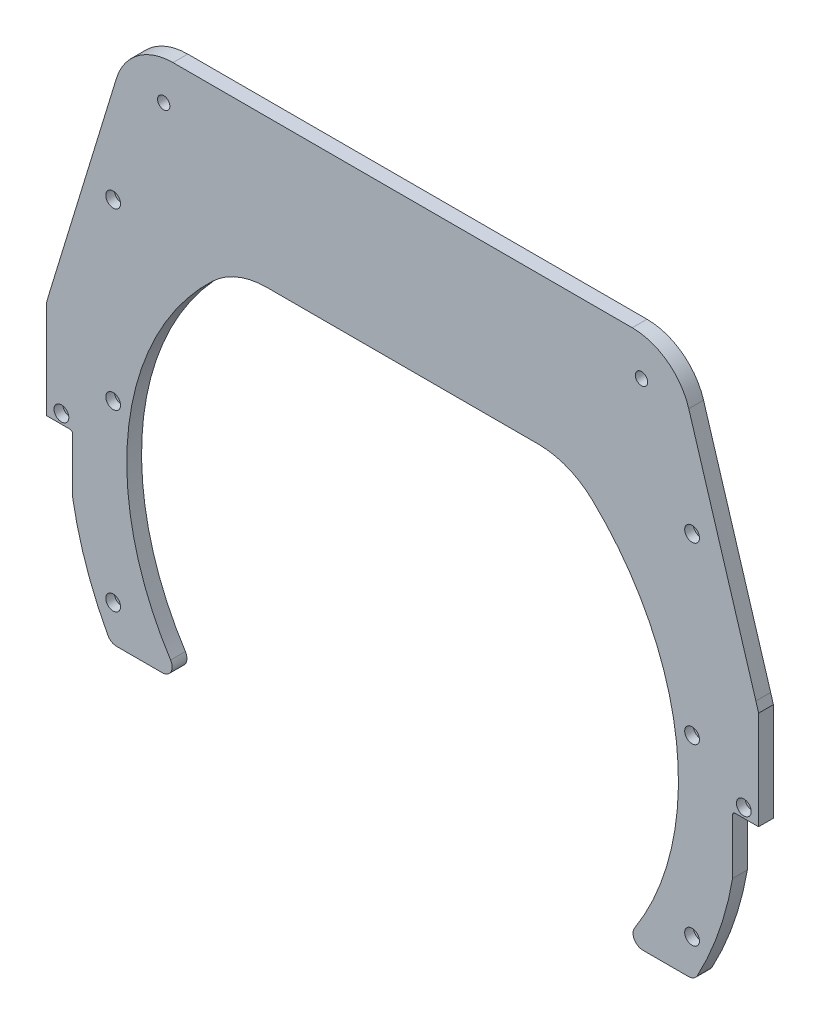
from build123d import *

# Parameters (mm, degrees)
SKETCH1_R                                       = 238.125
BOSS_EXTRUDE1_DEPTH                             = 4.7625
SKETCH5_OUTSIDE_W                               = 612.968
SKETCH5_OUTSIDE_H                               = 612.968
CUT_EXTRUDE2_DEPTH                              = 337.894281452
SKETCH11_W                                      = 376.234303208
SKETCH11_H                                      = 90.9030922
CUT_EXTRUDE5_DEPTH                              = 337.894185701
FILLET5_R                                       = 6.35
BOSS_EXTRUDE4_DEPTH                             = 9.525
FILLET3_R                                       = 38.1
CBORE_FOR_10_SOCKET_HEAD_CAP_SCREW1_D           = 5.6134
CBORE_FOR_10_SOCKET_HEAD_CAP_SCREW1_CBORE_D     = 9.525
CBORE_FOR_10_SOCKET_HEAD_CAP_SCREW1_CBORE_DEPTH = 5.588
F_3_8_16_TAPPED_HOLE1_D                         = 7.9375
F_3_8_16_TAPPED_HOLE1_DEPTH                     = 31.75
F_3_8_16_TAPPED_HOLE1_TIP                       = 2.384665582
CUT_EXTRUDE6_DEPTH                              = 337.894185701
FILLET7_R                                       = 1.5875


with BuildPart() as part:
    # Sketch1 → Boss-Extrude1 (new, symmetric)
    with BuildSketch(Plane.XY):
        with Locations(Location((0, 0, 0), (0, 0, 180))):
            Circle(SKETCH1_R)
    extrude(amount=BOSS_EXTRUDE1_DEPTH, both=True)

    # Sketch5 outside → Cut-Extrude2 (cut, through all)
    # profile 1 of 2: a face of its own
    with BuildSketch(Plane.XY.offset(4.7625)):
        Rectangle(SKETCH5_OUTSIDE_W, SKETCH5_OUTSIDE_H)
        with BuildLine():
            Line((-70.424906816, -196.85), (70.424906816, -196.85))
            ThreePointArc((70.424906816, -196.85), (90.321982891, -194.206416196), (108.838492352, -186.459090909))
            ThreePointArc((108.838492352, -186.459090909), (187.294400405, -107.394681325), (215.899850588, 0.254))
            Line((215.899850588, 0.254), (238.124864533, 0.254))
            ThreePointArc((238.124864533, 0.254), (216.229565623, 99.741117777), (154.762931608, 180.975))
            ThreePointArc((154.762931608, 180.975), (-99.510416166, 216.335833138), (-238.124864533, 0.254))
            Line((-238.124864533, 0.254), (-215.899850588, 0.254))
            ThreePointArc((-215.899850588, 0.254), (-187.294400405, -107.394681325), (-108.838492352, -186.459090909))
            ThreePointArc((-108.838492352, -186.459090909), (-90.321982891, -194.206416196), (-70.424906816, -196.85))
        make_face(mode=Mode.SUBTRACT)
    # profile 2 of 2: a face of its own
    with BuildSketch(Plane.XY.offset(4.7625)):
        with BuildLine():
            Line((-66.901401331, -158.75), (66.901401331, -158.75))
            ThreePointArc((66.901401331, -158.75), (80.813554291, -156.807875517), (93.661961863, -151.13))
            ThreePointArc((93.661961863, -151.13), (176.86725841, -18.188262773), (122.459548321, 128.905))
            ThreePointArc((122.459548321, 128.905), (106.308250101, 139.253406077), (87.471105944, 142.875))
            Line((87.471105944, 142.875), (-87.471105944, 142.875))
            ThreePointArc((-87.471105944, 142.875), (-106.308250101, 139.253406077), (-122.459548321, 128.905))
            ThreePointArc((-122.459548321, 128.905), (-176.86725841, -18.188262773), (-93.661961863, -151.13))
            ThreePointArc((-93.661961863, -151.13), (-80.813554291, -156.807875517), (-66.901401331, -158.75))
        make_face()
    extrude(amount=-CUT_EXTRUDE2_DEPTH, mode=Mode.SUBTRACT)

    # Sketch11 → Cut-Extrude5 (cut, through all)
    with BuildSketch(Plane(origin=(0, 0, -4.7625), x_dir=(-1, 0, 0), z_dir=(0, 0, -1))):
        with Locations((0, -151.3984539)):
            Rectangle(SKETCH11_W, SKETCH11_H)
    extrude(amount=-CUT_EXTRUDE5_DEPTH, mode=Mode.SUBTRACT)

    # Fillet5
    fillet5_edges = [part.edges().sort_by_distance(p)[0] for p in [
        (-142.786878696, -105.9469078, 0),
        (142.786878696, -105.9469078, 0),
        (188.117151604, -105.9469078, 0),
        (-188.117151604, -105.9469078, 0),
    ]]
    fillet(fillet5_edges, radius=FILLET5_R)

    # Sketch14 → Boss-Extrude4 (add)
    with BuildSketch(Plane.XY.offset(4.7625)):
        with BuildLine():
            Line((-176.203230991, 238.125), (0, 238.125))
            ThreePointArc((0, 238.125), (-141.642176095, 191.418414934), (-227.720070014, 69.621012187))
            Line((-227.720070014, 69.621012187), (-176.203230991, 238.125))
        make_face()
    boss_extrude4 = extrude(amount=-BOSS_EXTRUDE4_DEPTH)

    # Mirror1: Boss-Extrude4 across plane
    add(boss_extrude4.mirror(Plane(origin=(0, 0, 0), x_dir=(0, 0, 1), z_dir=(1, 0, 0))))

    # Fillet3
    fillet3_edges = [part.edges().sort_by_distance(p)[0] for p in [
        (-176.203230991, 238.125, 0),
        (176.203230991, 238.125, 0),
    ]]
    fillet(fillet3_edges, radius=FILLET3_R)

    # CBORE for _10 Socket Head Cap Screw1 (through all)
    with Locations(Plane(origin=(11.892213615, 12.059743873, 4.7625), x_dir=(-1, 0, 0), z_dir=(0, 0, 1))):
        with Locations((198.486963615, 94.609743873), (198.486963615, -17.865985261), (198.486963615, -130.341714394), (-174.702536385, -130.341714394), (-174.702536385, -17.865985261), (-174.702536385, 94.609743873), (231.824463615, 5.709743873), (-208.040036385, 5.709743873)):
            CounterBoreHole(CBORE_FOR_10_SOCKET_HEAD_CAP_SCREW1_D / 2, CBORE_FOR_10_SOCKET_HEAD_CAP_SCREW1_CBORE_D / 2, CBORE_FOR_10_SOCKET_HEAD_CAP_SCREW1_CBORE_DEPTH)

    # 3_8-16 Tapped Hole1
    with Locations(Plane.XY.offset(4.7625)):
        with Locations((-153.9875, 212.725), (153.9875, 212.725)):
            Hole(F_3_8_16_TAPPED_HOLE1_D / 2, depth=F_3_8_16_TAPPED_HOLE1_DEPTH)
            with Locations((0, 0, -(F_3_8_16_TAPPED_HOLE1_DEPTH + F_3_8_16_TAPPED_HOLE1_TIP / 2))):  # 118° drill point
                Cone(0, F_3_8_16_TAPPED_HOLE1_D / 2, F_3_8_16_TAPPED_HOLE1_TIP, mode=Mode.SUBTRACT)

    # Sketch18 → Cut-Extrude6 (cut, through all)
    with BuildSketch(Plane.XY.offset(4.7625)):
        Polygon((-229.4509, 0.254), (-212.725, 0.254), (-212.725, -36.890166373), (-238.125, -36.890166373), (-238.125, 63.685164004), (-229.4509, 63.685164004), align=None)
        Polygon((212.725, 0.254), (212.725, -36.890166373), (238.125, -36.890166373), (238.125, 63.685164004), (229.4509, 63.685164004), (229.4509, 0.254), align=None)
    extrude(amount=-CUT_EXTRUDE6_DEPTH, mode=Mode.SUBTRACT)

    # Fillet7
    fillet7_edges = [part.edges().sort_by_distance(p)[0] for p in [
        (-212.725, 0.254, 0),
        (212.725, 0.254, 0),
    ]]
    fillet(fillet7_edges, radius=FILLET7_R)


solid = part.part
